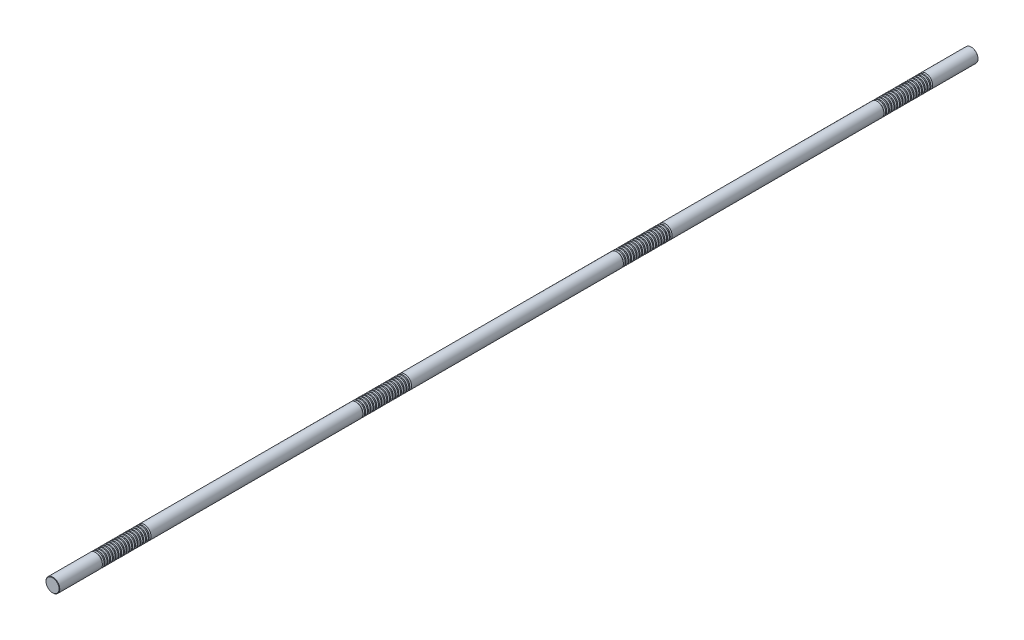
from build123d import *

# Parameters (mm, degrees)
SKETCH1_R           = 15
BOSS_EXTRUDE1_DEPTH = 1000
CHAMFER1_SIZE       = 0.75
LPATTERN1_COUNT     = 18
LPATTERN1_PITCH     = 6
LPATTERN2_COUNT     = 4
LPATTERN2_PITCH     = 567


with BuildPart() as part:
    # Sketch1 → Boss-Extrude1 (new, symmetric)
    with BuildSketch(Plane.XY):
        Circle(SKETCH1_R)
    extrude(amount=BOSS_EXTRUDE1_DEPTH, both=True)

    # Chamfer1
    chamfer1_edges = [part.edges().sort_by_distance(p)[0] for p in [
        (-15, 0, -1000),
        (-15, 0, 1000),
    ]]
    chamfer(chamfer1_edges, length=CHAMFER1_SIZE)

    # Sketch2 → Cut-Revolve1 (revolve, cut)
    with BuildSketch(Plane(origin=(0, 0, 0), x_dir=(0, 0, -1), z_dir=(1, 0, 0)), mode=Mode.PRIVATE) as cut_revolve1_sk:
        Polygon((900.468911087, 15), (896.531088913, 15), (897.468911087, 11.5), (899.531088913, 11.5), align=None)
    cut_revolve1 = revolve(cut_revolve1_sk.sketch.rotate(Axis((0, 0, 1000), (0, 0, -1)), 90), axis=Axis((0, 0, 1000), (0, 0, -1)), mode=Mode.SUBTRACT)

    # LPattern1: Cut-Revolve1 ×18
    with Locations(*[(0, 0, i * LPATTERN1_PITCH) for i in range(1, LPATTERN1_COUNT)]):
        add(cut_revolve1, mode=Mode.SUBTRACT)

    # LPattern2: Cut-Revolve1 ×4
    with Locations(*[(0, 0, i * LPATTERN2_PITCH) for i in range(1, LPATTERN2_COUNT)]):
        add(cut_revolve1, mode=Mode.SUBTRACT)

    # LPattern2 copy 1 sketch → LPattern2 copy 1 (revolve, cut)
    with BuildSketch(Plane(origin=(0, 0, 573), x_dir=(0, 0, -1), z_dir=(1, 0, 0))):
        Polygon((900.468911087, 15), (896.531088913, 15), (897.468911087, 11.5), (899.531088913, 11.5), align=None)
    revolve(axis=Axis((0, 0, 1573), (0, 0, -1)), mode=Mode.SUBTRACT)

    # LPattern2 copy 2 sketch → LPattern2 copy 2 (revolve, cut)
    with BuildSketch(Plane(origin=(0, 0, 1140), x_dir=(0, 0, -1), z_dir=(1, 0, 0))):
        Polygon((900.468911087, 15), (896.531088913, 15), (897.468911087, 11.5), (899.531088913, 11.5), align=None)
    revolve(axis=Axis((0, 0, 2140), (0, 0, -1)), mode=Mode.SUBTRACT)

    # LPattern2 copy 3 sketch → LPattern2 copy 3 (revolve, cut)
    with BuildSketch(Plane(origin=(0, 0, 1707), x_dir=(0, 0, -1), z_dir=(1, 0, 0))):
        Polygon((900.468911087, 15), (896.531088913, 15), (897.468911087, 11.5), (899.531088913, 11.5), align=None)
    revolve(axis=Axis((0, 0, 2707), (0, 0, -1)), mode=Mode.SUBTRACT)

    # LPattern2 copy 4 sketch → LPattern2 copy 4 (revolve, cut)
    with BuildSketch(Plane(origin=(0, 0, 579), x_dir=(0, 0, -1), z_dir=(1, 0, 0))):
        Polygon((900.468911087, 15), (896.531088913, 15), (897.468911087, 11.5), (899.531088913, 11.5), align=None)
    revolve(axis=Axis((0, 0, 1579), (0, 0, -1)), mode=Mode.SUBTRACT)

    # LPattern2 copy 5 sketch → LPattern2 copy 5 (revolve, cut)
    with BuildSketch(Plane(origin=(0, 0, 1146), x_dir=(0, 0, -1), z_dir=(1, 0, 0))):
        Polygon((900.468911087, 15), (896.531088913, 15), (897.468911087, 11.5), (899.531088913, 11.5), align=None)
    revolve(axis=Axis((0, 0, 2146), (0, 0, -1)), mode=Mode.SUBTRACT)

    # LPattern2 copy 6 sketch → LPattern2 copy 6 (revolve, cut)
    with BuildSketch(Plane(origin=(0, 0, 1713), x_dir=(0, 0, -1), z_dir=(1, 0, 0))):
        Polygon((900.468911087, 15), (896.531088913, 15), (897.468911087, 11.5), (899.531088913, 11.5), align=None)
    revolve(axis=Axis((0, 0, 2713), (0, 0, -1)), mode=Mode.SUBTRACT)

    # LPattern2 copy 7 sketch → LPattern2 copy 7 (revolve, cut)
    with BuildSketch(Plane(origin=(0, 0, 585), x_dir=(0, 0, -1), z_dir=(1, 0, 0))):
        Polygon((900.468911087, 15), (896.531088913, 15), (897.468911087, 11.5), (899.531088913, 11.5), align=None)
    revolve(axis=Axis((0, 0, 1585), (0, 0, -1)), mode=Mode.SUBTRACT)

    # LPattern2 copy 8 sketch → LPattern2 copy 8 (revolve, cut)
    with BuildSketch(Plane(origin=(0, 0, 1152), x_dir=(0, 0, -1), z_dir=(1, 0, 0))):
        Polygon((900.468911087, 15), (896.531088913, 15), (897.468911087, 11.5), (899.531088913, 11.5), align=None)
    revolve(axis=Axis((0, 0, 2152), (0, 0, -1)), mode=Mode.SUBTRACT)

    # LPattern2 copy 9 sketch → LPattern2 copy 9 (revolve, cut)
    with BuildSketch(Plane(origin=(0, 0, 1719), x_dir=(0, 0, -1), z_dir=(1, 0, 0))):
        Polygon((900.468911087, 15), (896.531088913, 15), (897.468911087, 11.5), (899.531088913, 11.5), align=None)
    revolve(axis=Axis((0, 0, 2719), (0, 0, -1)), mode=Mode.SUBTRACT)

    # LPattern2 copy 10 sketch → LPattern2 copy 10 (revolve, cut)
    with BuildSketch(Plane(origin=(0, 0, 591), x_dir=(0, 0, -1), z_dir=(1, 0, 0))):
        Polygon((900.468911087, 15), (896.531088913, 15), (897.468911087, 11.5), (899.531088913, 11.5), align=None)
    revolve(axis=Axis((0, 0, 1591), (0, 0, -1)), mode=Mode.SUBTRACT)

    # LPattern2 copy 11 sketch → LPattern2 copy 11 (revolve, cut)
    with BuildSketch(Plane(origin=(0, 0, 1158), x_dir=(0, 0, -1), z_dir=(1, 0, 0))):
        Polygon((900.468911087, 15), (896.531088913, 15), (897.468911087, 11.5), (899.531088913, 11.5), align=None)
    revolve(axis=Axis((0, 0, 2158), (0, 0, -1)), mode=Mode.SUBTRACT)

    # LPattern2 copy 12 sketch → LPattern2 copy 12 (revolve, cut)
    with BuildSketch(Plane(origin=(0, 0, 1725), x_dir=(0, 0, -1), z_dir=(1, 0, 0))):
        Polygon((900.468911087, 15), (896.531088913, 15), (897.468911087, 11.5), (899.531088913, 11.5), align=None)
    revolve(axis=Axis((0, 0, 2725), (0, 0, -1)), mode=Mode.SUBTRACT)

    # LPattern2 copy 13 sketch → LPattern2 copy 13 (revolve, cut)
    with BuildSketch(Plane(origin=(0, 0, 597), x_dir=(0, 0, -1), z_dir=(1, 0, 0))):
        Polygon((900.468911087, 15), (896.531088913, 15), (897.468911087, 11.5), (899.531088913, 11.5), align=None)
    revolve(axis=Axis((0, 0, 1597), (0, 0, -1)), mode=Mode.SUBTRACT)

    # LPattern2 copy 14 sketch → LPattern2 copy 14 (revolve, cut)
    with BuildSketch(Plane(origin=(0, 0, 1164), x_dir=(0, 0, -1), z_dir=(1, 0, 0))):
        Polygon((900.468911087, 15), (896.531088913, 15), (897.468911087, 11.5), (899.531088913, 11.5), align=None)
    revolve(axis=Axis((0, 0, 2164), (0, 0, -1)), mode=Mode.SUBTRACT)

    # LPattern2 copy 15 sketch → LPattern2 copy 15 (revolve, cut)
    with BuildSketch(Plane(origin=(0, 0, 1731), x_dir=(0, 0, -1), z_dir=(1, 0, 0))):
        Polygon((900.468911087, 15), (896.531088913, 15), (897.468911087, 11.5), (899.531088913, 11.5), align=None)
    revolve(axis=Axis((0, 0, 2731), (0, 0, -1)), mode=Mode.SUBTRACT)

    # LPattern2 copy 16 sketch → LPattern2 copy 16 (revolve, cut)
    with BuildSketch(Plane(origin=(0, 0, 603), x_dir=(0, 0, -1), z_dir=(1, 0, 0))):
        Polygon((900.468911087, 15), (896.531088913, 15), (897.468911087, 11.5), (899.531088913, 11.5), align=None)
    revolve(axis=Axis((0, 0, 1603), (0, 0, -1)), mode=Mode.SUBTRACT)

    # LPattern2 copy 17 sketch → LPattern2 copy 17 (revolve, cut)
    with BuildSketch(Plane(origin=(0, 0, 1170), x_dir=(0, 0, -1), z_dir=(1, 0, 0))):
        Polygon((900.468911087, 15), (896.531088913, 15), (897.468911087, 11.5), (899.531088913, 11.5), align=None)
    revolve(axis=Axis((0, 0, 2170), (0, 0, -1)), mode=Mode.SUBTRACT)

    # LPattern2 copy 18 sketch → LPattern2 copy 18 (revolve, cut)
    with BuildSketch(Plane(origin=(0, 0, 1737), x_dir=(0, 0, -1), z_dir=(1, 0, 0))):
        Polygon((900.468911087, 15), (896.531088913, 15), (897.468911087, 11.5), (899.531088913, 11.5), align=None)
    revolve(axis=Axis((0, 0, 2737), (0, 0, -1)), mode=Mode.SUBTRACT)

    # LPattern2 copy 19 sketch → LPattern2 copy 19 (revolve, cut)
    with BuildSketch(Plane(origin=(0, 0, 609), x_dir=(0, 0, -1), z_dir=(1, 0, 0))):
        Polygon((900.468911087, 15), (896.531088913, 15), (897.468911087, 11.5), (899.531088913, 11.5), align=None)
    revolve(axis=Axis((0, 0, 1609), (0, 0, -1)), mode=Mode.SUBTRACT)

    # LPattern2 copy 20 sketch → LPattern2 copy 20 (revolve, cut)
    with BuildSketch(Plane(origin=(0, 0, 1176), x_dir=(0, 0, -1), z_dir=(1, 0, 0))):
        Polygon((900.468911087, 15), (896.531088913, 15), (897.468911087, 11.5), (899.531088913, 11.5), align=None)
    revolve(axis=Axis((0, 0, 2176), (0, 0, -1)), mode=Mode.SUBTRACT)

    # LPattern2 copy 21 sketch → LPattern2 copy 21 (revolve, cut)
    with BuildSketch(Plane(origin=(0, 0, 1743), x_dir=(0, 0, -1), z_dir=(1, 0, 0))):
        Polygon((900.468911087, 15), (896.531088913, 15), (897.468911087, 11.5), (899.531088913, 11.5), align=None)
    revolve(axis=Axis((0, 0, 2743), (0, 0, -1)), mode=Mode.SUBTRACT)

    # LPattern2 copy 22 sketch → LPattern2 copy 22 (revolve, cut)
    with BuildSketch(Plane(origin=(0, 0, 615), x_dir=(0, 0, -1), z_dir=(1, 0, 0))):
        Polygon((900.468911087, 15), (896.531088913, 15), (897.468911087, 11.5), (899.531088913, 11.5), align=None)
    revolve(axis=Axis((0, 0, 1615), (0, 0, -1)), mode=Mode.SUBTRACT)

    # LPattern2 copy 23 sketch → LPattern2 copy 23 (revolve, cut)
    with BuildSketch(Plane(origin=(0, 0, 1182), x_dir=(0, 0, -1), z_dir=(1, 0, 0))):
        Polygon((900.468911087, 15), (896.531088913, 15), (897.468911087, 11.5), (899.531088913, 11.5), align=None)
    revolve(axis=Axis((0, 0, 2182), (0, 0, -1)), mode=Mode.SUBTRACT)

    # LPattern2 copy 24 sketch → LPattern2 copy 24 (revolve, cut)
    with BuildSketch(Plane(origin=(0, 0, 1749), x_dir=(0, 0, -1), z_dir=(1, 0, 0))):
        Polygon((900.468911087, 15), (896.531088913, 15), (897.468911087, 11.5), (899.531088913, 11.5), align=None)
    revolve(axis=Axis((0, 0, 2749), (0, 0, -1)), mode=Mode.SUBTRACT)

    # LPattern2 copy 25 sketch → LPattern2 copy 25 (revolve, cut)
    with BuildSketch(Plane(origin=(0, 0, 621), x_dir=(0, 0, -1), z_dir=(1, 0, 0))):
        Polygon((900.468911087, 15), (896.531088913, 15), (897.468911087, 11.5), (899.531088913, 11.5), align=None)
    revolve(axis=Axis((0, 0, 1621), (0, 0, -1)), mode=Mode.SUBTRACT)

    # LPattern2 copy 26 sketch → LPattern2 copy 26 (revolve, cut)
    with BuildSketch(Plane(origin=(0, 0, 1188), x_dir=(0, 0, -1), z_dir=(1, 0, 0))):
        Polygon((900.468911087, 15), (896.531088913, 15), (897.468911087, 11.5), (899.531088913, 11.5), align=None)
    revolve(axis=Axis((0, 0, 2188), (0, 0, -1)), mode=Mode.SUBTRACT)

    # LPattern2 copy 27 sketch → LPattern2 copy 27 (revolve, cut)
    with BuildSketch(Plane(origin=(0, 0, 1755), x_dir=(0, 0, -1), z_dir=(1, 0, 0))):
        Polygon((900.468911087, 15), (896.531088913, 15), (897.468911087, 11.5), (899.531088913, 11.5), align=None)
    revolve(axis=Axis((0, 0, 2755), (0, 0, -1)), mode=Mode.SUBTRACT)

    # LPattern2 copy 28 sketch → LPattern2 copy 28 (revolve, cut)
    with BuildSketch(Plane(origin=(0, 0, 627), x_dir=(0, 0, -1), z_dir=(1, 0, 0))):
        Polygon((900.468911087, 15), (896.531088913, 15), (897.468911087, 11.5), (899.531088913, 11.5), align=None)
    revolve(axis=Axis((0, 0, 1627), (0, 0, -1)), mode=Mode.SUBTRACT)

    # LPattern2 copy 29 sketch → LPattern2 copy 29 (revolve, cut)
    with BuildSketch(Plane(origin=(0, 0, 1194), x_dir=(0, 0, -1), z_dir=(1, 0, 0))):
        Polygon((900.468911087, 15), (896.531088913, 15), (897.468911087, 11.5), (899.531088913, 11.5), align=None)
    revolve(axis=Axis((0, 0, 2194), (0, 0, -1)), mode=Mode.SUBTRACT)

    # LPattern2 copy 30 sketch → LPattern2 copy 30 (revolve, cut)
    with BuildSketch(Plane(origin=(0, 0, 1761), x_dir=(0, 0, -1), z_dir=(1, 0, 0))):
        Polygon((900.468911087, 15), (896.531088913, 15), (897.468911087, 11.5), (899.531088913, 11.5), align=None)
    revolve(axis=Axis((0, 0, 2761), (0, 0, -1)), mode=Mode.SUBTRACT)

    # LPattern2 copy 31 sketch → LPattern2 copy 31 (revolve, cut)
    with BuildSketch(Plane(origin=(0, 0, 633), x_dir=(0, 0, -1), z_dir=(1, 0, 0))):
        Polygon((900.468911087, 15), (896.531088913, 15), (897.468911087, 11.5), (899.531088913, 11.5), align=None)
    revolve(axis=Axis((0, 0, 1633), (0, 0, -1)), mode=Mode.SUBTRACT)

    # LPattern2 copy 32 sketch → LPattern2 copy 32 (revolve, cut)
    with BuildSketch(Plane(origin=(0, 0, 1200), x_dir=(0, 0, -1), z_dir=(1, 0, 0))):
        Polygon((900.468911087, 15), (896.531088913, 15), (897.468911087, 11.5), (899.531088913, 11.5), align=None)
    revolve(axis=Axis((0, 0, 2200), (0, 0, -1)), mode=Mode.SUBTRACT)

    # LPattern2 copy 33 sketch → LPattern2 copy 33 (revolve, cut)
    with BuildSketch(Plane(origin=(0, 0, 1767), x_dir=(0, 0, -1), z_dir=(1, 0, 0))):
        Polygon((900.468911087, 15), (896.531088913, 15), (897.468911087, 11.5), (899.531088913, 11.5), align=None)
    revolve(axis=Axis((0, 0, 2767), (0, 0, -1)), mode=Mode.SUBTRACT)

    # LPattern2 copy 34 sketch → LPattern2 copy 34 (revolve, cut)
    with BuildSketch(Plane(origin=(0, 0, 639), x_dir=(0, 0, -1), z_dir=(1, 0, 0))):
        Polygon((900.468911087, 15), (896.531088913, 15), (897.468911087, 11.5), (899.531088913, 11.5), align=None)
    revolve(axis=Axis((0, 0, 1639), (0, 0, -1)), mode=Mode.SUBTRACT)

    # LPattern2 copy 35 sketch → LPattern2 copy 35 (revolve, cut)
    with BuildSketch(Plane(origin=(0, 0, 1206), x_dir=(0, 0, -1), z_dir=(1, 0, 0))):
        Polygon((900.468911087, 15), (896.531088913, 15), (897.468911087, 11.5), (899.531088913, 11.5), align=None)
    revolve(axis=Axis((0, 0, 2206), (0, 0, -1)), mode=Mode.SUBTRACT)

    # LPattern2 copy 36 sketch → LPattern2 copy 36 (revolve, cut)
    with BuildSketch(Plane(origin=(0, 0, 1773), x_dir=(0, 0, -1), z_dir=(1, 0, 0))):
        Polygon((900.468911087, 15), (896.531088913, 15), (897.468911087, 11.5), (899.531088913, 11.5), align=None)
    revolve(axis=Axis((0, 0, 2773), (0, 0, -1)), mode=Mode.SUBTRACT)

    # LPattern2 copy 37 sketch → LPattern2 copy 37 (revolve, cut)
    with BuildSketch(Plane(origin=(0, 0, 645), x_dir=(0, 0, -1), z_dir=(1, 0, 0))):
        Polygon((900.468911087, 15), (896.531088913, 15), (897.468911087, 11.5), (899.531088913, 11.5), align=None)
    revolve(axis=Axis((0, 0, 1645), (0, 0, -1)), mode=Mode.SUBTRACT)

    # LPattern2 copy 38 sketch → LPattern2 copy 38 (revolve, cut)
    with BuildSketch(Plane(origin=(0, 0, 1212), x_dir=(0, 0, -1), z_dir=(1, 0, 0))):
        Polygon((900.468911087, 15), (896.531088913, 15), (897.468911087, 11.5), (899.531088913, 11.5), align=None)
    revolve(axis=Axis((0, 0, 2212), (0, 0, -1)), mode=Mode.SUBTRACT)

    # LPattern2 copy 39 sketch → LPattern2 copy 39 (revolve, cut)
    with BuildSketch(Plane(origin=(0, 0, 1779), x_dir=(0, 0, -1), z_dir=(1, 0, 0))):
        Polygon((900.468911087, 15), (896.531088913, 15), (897.468911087, 11.5), (899.531088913, 11.5), align=None)
    revolve(axis=Axis((0, 0, 2779), (0, 0, -1)), mode=Mode.SUBTRACT)

    # LPattern2 copy 40 sketch → LPattern2 copy 40 (revolve, cut)
    with BuildSketch(Plane(origin=(0, 0, 651), x_dir=(0, 0, -1), z_dir=(1, 0, 0))):
        Polygon((900.468911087, 15), (896.531088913, 15), (897.468911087, 11.5), (899.531088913, 11.5), align=None)
    revolve(axis=Axis((0, 0, 1651), (0, 0, -1)), mode=Mode.SUBTRACT)

    # LPattern2 copy 41 sketch → LPattern2 copy 41 (revolve, cut)
    with BuildSketch(Plane(origin=(0, 0, 1218), x_dir=(0, 0, -1), z_dir=(1, 0, 0))):
        Polygon((900.468911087, 15), (896.531088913, 15), (897.468911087, 11.5), (899.531088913, 11.5), align=None)
    revolve(axis=Axis((0, 0, 2218), (0, 0, -1)), mode=Mode.SUBTRACT)

    # LPattern2 copy 42 sketch → LPattern2 copy 42 (revolve, cut)
    with BuildSketch(Plane(origin=(0, 0, 1785), x_dir=(0, 0, -1), z_dir=(1, 0, 0))):
        Polygon((900.468911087, 15), (896.531088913, 15), (897.468911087, 11.5), (899.531088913, 11.5), align=None)
    revolve(axis=Axis((0, 0, 2785), (0, 0, -1)), mode=Mode.SUBTRACT)

    # LPattern2 copy 43 sketch → LPattern2 copy 43 (revolve, cut)
    with BuildSketch(Plane(origin=(0, 0, 657), x_dir=(0, 0, -1), z_dir=(1, 0, 0))):
        Polygon((900.468911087, 15), (896.531088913, 15), (897.468911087, 11.5), (899.531088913, 11.5), align=None)
    revolve(axis=Axis((0, 0, 1657), (0, 0, -1)), mode=Mode.SUBTRACT)

    # LPattern2 copy 44 sketch → LPattern2 copy 44 (revolve, cut)
    with BuildSketch(Plane(origin=(0, 0, 1224), x_dir=(0, 0, -1), z_dir=(1, 0, 0))):
        Polygon((900.468911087, 15), (896.531088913, 15), (897.468911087, 11.5), (899.531088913, 11.5), align=None)
    revolve(axis=Axis((0, 0, 2224), (0, 0, -1)), mode=Mode.SUBTRACT)

    # LPattern2 copy 45 sketch → LPattern2 copy 45 (revolve, cut)
    with BuildSketch(Plane(origin=(0, 0, 1791), x_dir=(0, 0, -1), z_dir=(1, 0, 0))):
        Polygon((900.468911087, 15), (896.531088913, 15), (897.468911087, 11.5), (899.531088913, 11.5), align=None)
    revolve(axis=Axis((0, 0, 2791), (0, 0, -1)), mode=Mode.SUBTRACT)

    # LPattern2 copy 46 sketch → LPattern2 copy 46 (revolve, cut)
    with BuildSketch(Plane(origin=(0, 0, 663), x_dir=(0, 0, -1), z_dir=(1, 0, 0))):
        Polygon((900.468911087, 15), (896.531088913, 15), (897.468911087, 11.5), (899.531088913, 11.5), align=None)
    revolve(axis=Axis((0, 0, 1663), (0, 0, -1)), mode=Mode.SUBTRACT)

    # LPattern2 copy 47 sketch → LPattern2 copy 47 (revolve, cut)
    with BuildSketch(Plane(origin=(0, 0, 1230), x_dir=(0, 0, -1), z_dir=(1, 0, 0))):
        Polygon((900.468911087, 15), (896.531088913, 15), (897.468911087, 11.5), (899.531088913, 11.5), align=None)
    revolve(axis=Axis((0, 0, 2230), (0, 0, -1)), mode=Mode.SUBTRACT)

    # LPattern2 copy 48 sketch → LPattern2 copy 48 (revolve, cut)
    with BuildSketch(Plane(origin=(0, 0, 1797), x_dir=(0, 0, -1), z_dir=(1, 0, 0))):
        Polygon((900.468911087, 15), (896.531088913, 15), (897.468911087, 11.5), (899.531088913, 11.5), align=None)
    revolve(axis=Axis((0, 0, 2797), (0, 0, -1)), mode=Mode.SUBTRACT)

    # LPattern2 copy 49 sketch → LPattern2 copy 49 (revolve, cut)
    with BuildSketch(Plane(origin=(0, 0, 669), x_dir=(0, 0, -1), z_dir=(1, 0, 0))):
        Polygon((900.468911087, 15), (896.531088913, 15), (897.468911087, 11.5), (899.531088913, 11.5), align=None)
    revolve(axis=Axis((0, 0, 1669), (0, 0, -1)), mode=Mode.SUBTRACT)

    # LPattern2 copy 50 sketch → LPattern2 copy 50 (revolve, cut)
    with BuildSketch(Plane(origin=(0, 0, 1236), x_dir=(0, 0, -1), z_dir=(1, 0, 0))):
        Polygon((900.468911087, 15), (896.531088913, 15), (897.468911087, 11.5), (899.531088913, 11.5), align=None)
    revolve(axis=Axis((0, 0, 2236), (0, 0, -1)), mode=Mode.SUBTRACT)

    # LPattern2 copy 51 sketch → LPattern2 copy 51 (revolve, cut)
    with BuildSketch(Plane(origin=(0, 0, 1803), x_dir=(0, 0, -1), z_dir=(1, 0, 0))):
        Polygon((900.468911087, 15), (896.531088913, 15), (897.468911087, 11.5), (899.531088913, 11.5), align=None)
    revolve(axis=Axis((0, 0, 2803), (0, 0, -1)), mode=Mode.SUBTRACT)


solid = part.part
